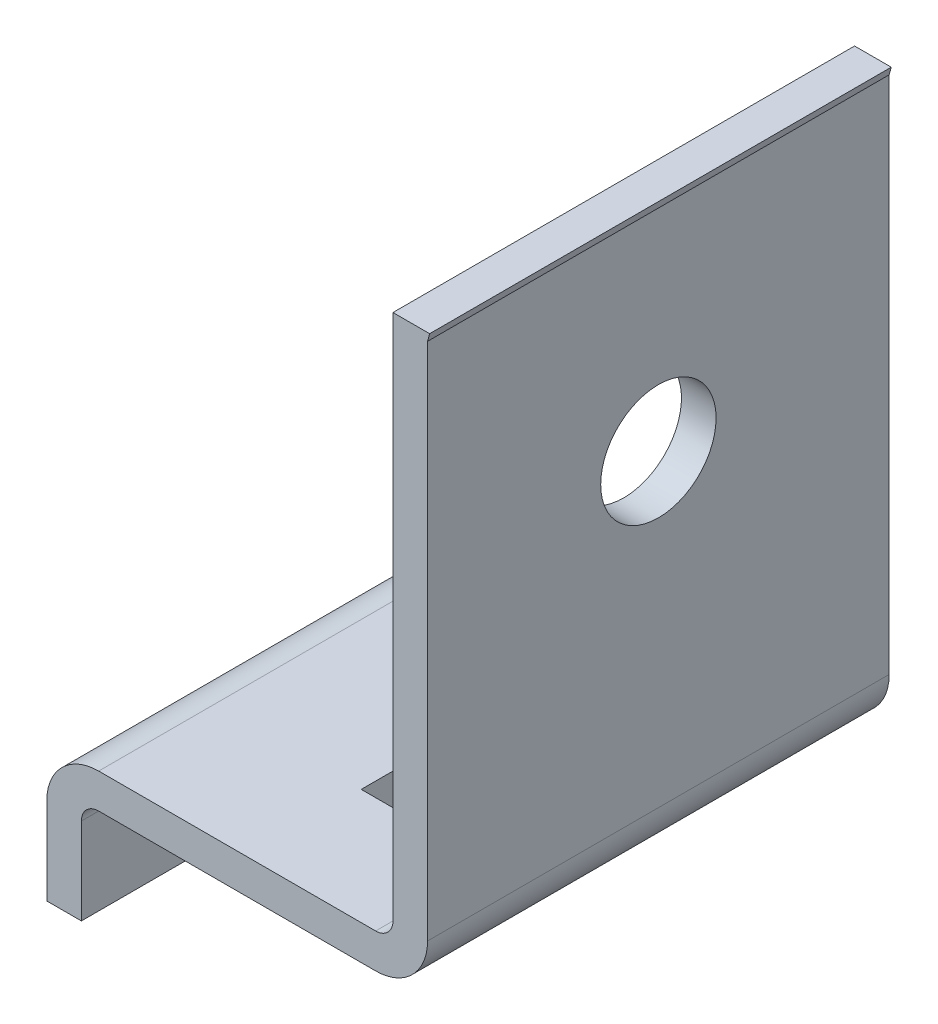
from build123d import *

# Parameters (mm, degrees)
CORPS_DEPTH                         = 80
CHANFREIN1_SIZE                     = 15
CHANFREIN2_SIZE                     = 15
TROU_OUBLON_DEPTH                   = 50
ESQUISSE3_W                         = 13
ESQUISSE3_H                         = 13
TROU_DE_FIXATION_DEPTH              = 50
ESQUISSE4_R                         = 10
TROU_DE_FIXATION_DES_RENFORTS_DEPTH = 10
ESQUISSE5_W                         = 13
ESQUISSE5_H                         = 40
TROU_DE_FIXATION_SUR_CHASSIS_DEPTH  = 10
ESQUISSE6_W                         = 124.821722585
ESQUISSE6_H                         = 84.290531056
ENL_V_MAT_EXTRU_1_DEPTH             = 214.455787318


with BuildPart() as part:
    # Esquisse1 → corps (new body)
    with BuildSketch(Plane.XY):
        with BuildLine():
            Line((0, 0), (6, 0))
            Line((6, 0), (6, 12))
            Line((6, 12), (6, 15))
            ThreePointArc((6, 15), (6.878679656, 17.121320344), (9, 18))
            Line((9, 18), (57, 18))
            ThreePointArc((57, 18), (63.363961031, 20.636038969), (66, 27))
            Line((66, 27), (66, 30))
            Line((66, 30), (66, 117))
            Line((66, 117), (84.76438077, 187.029622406))
            Line((84.76438077, 187.029622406), (78.968825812, 188.582536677))
            Line((78.968825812, 188.582536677), (60, 118.608015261))
            Line((60, 118.608015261), (60, 30))
            Line((60, 30), (60, 27))
            ThreePointArc((60, 27), (59.121320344, 24.878679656), (57, 24))
            Line((57, 24), (48, 24))
            Line((48, 24), (13.494646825, 24))
            Line((13.494646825, 24), (12, 24))
            Line((12, 24), (9, 24))
            ThreePointArc((9, 24), (2.636038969, 21.363961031), (0, 15))
            Line((0, 15), (0, 12))
            Line((0, 12), (0, 0))
        make_face()
    extrude(amount=-CORPS_DEPTH)

    # Chanfrein1
    chanfrein1_edges = [part.edges().sort_by_distance(p)[0] for p in [
        (81.866603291, 187.806079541, 0),
    ]]
    chamfer(chanfrein1_edges, length=CHANFREIN1_SIZE)

    # Chanfrein2
    chanfrein2_edges = [part.edges().sort_by_distance(p)[0] for p in [
        (81.866603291, 187.806079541, -80),
    ]]
    chamfer(chanfrein2_edges, length=CHANFREIN2_SIZE)

    # Esquisse2 → trou oublon (cut)
    with BuildSketch(Plane(origin=(25.941214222, -7.03219349, 0), x_dir=(0, 0, 1), z_dir=(-0.9651658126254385, 0.2616389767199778, 0))):
        with BuildLine():
            Line((-32.5, 187.674740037), (-32.5, 167.674740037))
            ThreePointArc((-32.5, 167.674740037), (-40, 165.174740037), (-47.5, 167.674740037))
            Line((-47.5, 167.674740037), (-47.5, 187.674740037))
            ThreePointArc((-47.5, 187.674740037), (-40, 190.174740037), (-32.5, 187.674740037))
        make_face()
    extrude(amount=-TROU_OUBLON_DEPTH, mode=Mode.SUBTRACT)

    # Esquisse3 → trou de fixation (cut)
    with BuildSketch(Plane(origin=(25.941214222, -7.03219349, 0), x_dir=(0, 0, 1), z_dir=(-0.9651658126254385, 0.2616389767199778, 0))):
        with Locations((-15, 142.674740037)):
            Rectangle(ESQUISSE3_W, ESQUISSE3_H)
        with Locations((-65, 142.674740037)):
            Rectangle(ESQUISSE3_W, ESQUISSE3_H)
    extrude(amount=-TROU_DE_FIXATION_DEPTH, mode=Mode.SUBTRACT)

    # Esquisse4 → trou de fixation des renforts (cut)
    with BuildSketch(Plane.ZY.offset(-60)):
        with Locations((-40, 80.5)):
            Circle(ESQUISSE4_R)
    extrude(amount=-TROU_DE_FIXATION_DES_RENFORTS_DEPTH, mode=Mode.SUBTRACT)

    # Esquisse5 → trou de fixation sur chassis (cut)
    with BuildSketch(Plane(origin=(0, 24, 0), x_dir=(-1, 0, 0), z_dir=(0, 1, 0))):
        with Locations((-41, -40)):
            Rectangle(ESQUISSE5_W, ESQUISSE5_H)
    extrude(amount=-TROU_DE_FIXATION_SUR_CHASSIS_DEPTH, mode=Mode.SUBTRACT)

    # Esquisse6 → Enl_v. mat.-Extru.1 (cut, through all)
    with BuildSketch(Plane.ZY.offset(-60)):
        with Locations((-39.282633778, 160.468302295)):
            Rectangle(ESQUISSE6_W, ESQUISSE6_H)
    extrude(amount=-ENL_V_MAT_EXTRU_1_DEPTH, mode=Mode.SUBTRACT)


solid = part.part
